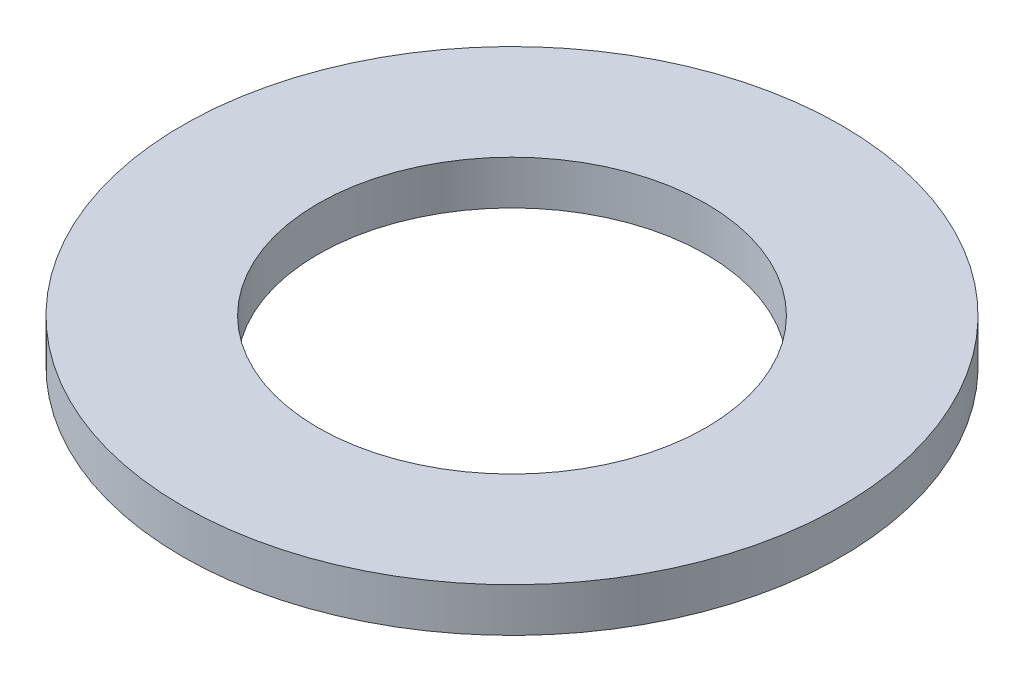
ISO-10303-21;
HEADER;
FILE_DESCRIPTION(('STEP AP214'),'2;1');
FILE_NAME('part.step','',(''),(''),'','','');
FILE_SCHEMA(('AUTOMOTIVE_DESIGN { 1 0 10303 214 1 1 1 1 }'));
ENDSEC;
DATA;
#1=APPLICATION_CONTEXT('core data for automotive mechanical design processes');
#2=APPLICATION_PROTOCOL_DEFINITION('international standard','automotive_design',2000,#1);
#3=PRODUCT_CONTEXT('',#1,'mechanical');
#4=PRODUCT('Part','Part','',(#3));
#5=PRODUCT_RELATED_PRODUCT_CATEGORY('part','',(#4));
#6=PRODUCT_DEFINITION_FORMATION('','',#4);
#7=PRODUCT_DEFINITION_CONTEXT('part definition',#1,'design');
#8=PRODUCT_DEFINITION('design','',#6,#7);
#9=PRODUCT_DEFINITION_SHAPE('','',#8);
#10=(LENGTH_UNIT() NAMED_UNIT(*) SI_UNIT(.MILLI.,.METRE.));
#11=(NAMED_UNIT(*) PLANE_ANGLE_UNIT() SI_UNIT($,.RADIAN.));
#12=(NAMED_UNIT(*) SI_UNIT($,.STERADIAN.) SOLID_ANGLE_UNIT());
#13=UNCERTAINTY_MEASURE_WITH_UNIT(LENGTH_MEASURE(1.E-05),#10,'distance_accuracy_value','');
#14=(GEOMETRIC_REPRESENTATION_CONTEXT(3) GLOBAL_UNCERTAINTY_ASSIGNED_CONTEXT((#13)) GLOBAL_UNIT_ASSIGNED_CONTEXT((#10,
#11,#12)) REPRESENTATION_CONTEXT('',''));
#15=CARTESIAN_POINT('',(0.,0.,0.));
#16=DIRECTION('',(0.,0.,1.));
#17=DIRECTION('',(1.,0.,0.));
#18=AXIS2_PLACEMENT_3D('',#15,#16,#17);
#19=CARTESIAN_POINT('',(-3.88578058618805E-13,0.,1.66533453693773E-13));
#20=DIRECTION('',(0.,-1.,0.));
#21=DIRECTION('',(0.,0.,-1.));
#22=AXIS2_PLACEMENT_3D('',#19,#20,#21);
#23=CYLINDRICAL_SURFACE('',#22,2.65);
#24=CARTESIAN_POINT('',(-3.88578058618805E-13,0.,1.66533453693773E-13));
#25=DIRECTION('',(0.,-1.,0.));
#26=DIRECTION('',(0.,0.,-1.));
#27=AXIS2_PLACEMENT_3D('',#24,#25,#26);
#28=CIRCLE('',#27,2.65);
#29=CARTESIAN_POINT('',(-3.88541282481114E-13,0.,-2.64999999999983));
#30=VERTEX_POINT('',#29);
#31=EDGE_CURVE('E50',#30,#30,#28,.T.);
#32=ORIENTED_EDGE('',*,*,#31,.T.);
#33=EDGE_LOOP('',(#32));
#34=FACE_BOUND('',#33,.T.);
#35=CARTESIAN_POINT('',(-1.11022302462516E-13,0.599999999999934,0.));
#36=DIRECTION('',(0.,-1.,0.));
#37=DIRECTION('',(0.,0.,-1.));
#38=AXIS2_PLACEMENT_3D('',#35,#36,#37);
#39=CIRCLE('',#38,2.65);
#40=CARTESIAN_POINT('',(-1.10985526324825E-13,0.599999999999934,-2.64999999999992));
#41=VERTEX_POINT('',#40);
#42=EDGE_CURVE('E10',#41,#41,#39,.T.);
#43=ORIENTED_EDGE('',*,*,#42,.F.);
#44=EDGE_LOOP('',(#43));
#45=FACE_BOUND('',#44,.T.);
#46=ADVANCED_FACE('F36',(#34,#45),#23,.F.);
#47=CARTESIAN_POINT('',(2.64999999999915,0.599999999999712,-4.9960036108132E-13));
#48=DIRECTION('',(0.,1.,0.));
#49=DIRECTION('',(0.,0.,1.));
#50=AXIS2_PLACEMENT_3D('',#47,#48,#49);
#51=PLANE('',#50);
#52=ORIENTED_EDGE('',*,*,#42,.T.);
#53=EDGE_LOOP('',(#52));
#54=FACE_BOUND('',#53,.T.);
#55=CARTESIAN_POINT('',(-1.11022302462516E-13,0.599999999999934,0.));
#56=DIRECTION('',(0.,-1.,0.));
#57=DIRECTION('',(0.,0.,-1.));
#58=AXIS2_PLACEMENT_3D('',#55,#56,#57);
#59=CIRCLE('',#58,4.5);
#60=CARTESIAN_POINT('',(-1.1095985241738E-13,0.599999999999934,-4.49999999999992));
#61=VERTEX_POINT('',#60);
#62=EDGE_CURVE('E42',#61,#61,#59,.T.);
#63=ORIENTED_EDGE('',*,*,#62,.F.);
#64=EDGE_LOOP('',(#63));
#65=FACE_BOUND('',#64,.T.);
#66=ADVANCED_FACE('F66',(#54,#65),#51,.T.);
#67=CARTESIAN_POINT('',(-3.88578058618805E-13,0.,1.66533453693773E-13));
#68=DIRECTION('',(0.,-1.,0.));
#69=DIRECTION('',(0.,0.,-1.));
#70=AXIS2_PLACEMENT_3D('',#67,#68,#69);
#71=CYLINDRICAL_SURFACE('',#70,4.5);
#72=ORIENTED_EDGE('',*,*,#62,.T.);
#73=EDGE_LOOP('',(#72));
#74=FACE_BOUND('',#73,.T.);
#75=CARTESIAN_POINT('',(-3.88578058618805E-13,0.,1.66533453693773E-13));
#76=DIRECTION('',(0.,-1.,0.));
#77=DIRECTION('',(0.,0.,-1.));
#78=AXIS2_PLACEMENT_3D('',#75,#76,#77);
#79=CIRCLE('',#78,4.5);
#80=CARTESIAN_POINT('',(-3.8851560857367E-13,0.,-4.49999999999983));
#81=VERTEX_POINT('',#80);
#82=EDGE_CURVE('E46',#81,#81,#79,.T.);
#83=ORIENTED_EDGE('',*,*,#82,.F.);
#84=EDGE_LOOP('',(#83));
#85=FACE_BOUND('',#84,.T.);
#86=ADVANCED_FACE('F60',(#74,#85),#71,.T.);
#87=CARTESIAN_POINT('',(2.64999999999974,-3.33066907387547E-13,1.11022302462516E-13));
#88=DIRECTION('',(0.,-1.,0.));
#89=DIRECTION('',(0.,0.,-1.));
#90=AXIS2_PLACEMENT_3D('',#87,#88,#89);
#91=PLANE('',#90);
#92=ORIENTED_EDGE('',*,*,#82,.T.);
#93=EDGE_LOOP('',(#92));
#94=FACE_BOUND('',#93,.T.);
#95=ORIENTED_EDGE('',*,*,#31,.F.);
#96=EDGE_LOOP('',(#95));
#97=FACE_BOUND('',#96,.T.);
#98=ADVANCED_FACE('F58',(#94,#97),#91,.T.);
#99=CLOSED_SHELL('',(#46,#66,#86,#98));
#100=MANIFOLD_SOLID_BREP('B2',#99);
#101=ADVANCED_BREP_SHAPE_REPRESENTATION('',(#18,#100),#14);
#102=SHAPE_DEFINITION_REPRESENTATION(#9,#101);
ENDSEC;
END-ISO-10303-21;
